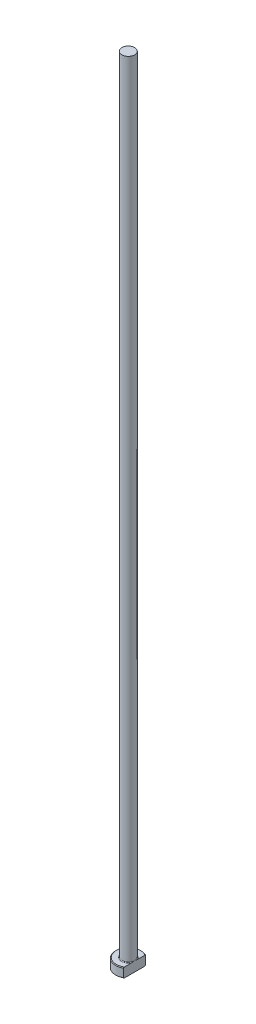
from build123d import *
from build123d.topology import SkipClean

# Parameters (mm, degrees)
CHAMFER1_SIZE = 0.2
FILLET1_R     = 0.2
KEY_DEPTH     = 251.06399181


with BuildPart() as part:
    # Sketch1 → Revolve1 (revolve)
    with BuildSketch(Plane.XY, mode=Mode.PRIVATE) as revolve1_sk:
        Polygon((0, 0), (-4, 0), (-4, 3), (-2, 3), (-2, 250), (0, 250), align=None)
    revolve(revolve1_sk.sketch.rotate(Axis((0, 259.958771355, 0), (0, -1, 0)), 270), axis=Axis((0, 259.958771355, 0), (0, -1, 0)))

    # Chamfer1
    chamfer1_edges = [part.edges().sort_by_distance(p)[0] for p in [
        (0, 3, -4),
        (0, 0, -4),
    ]]
    chamfer(chamfer1_edges, length=CHAMFER1_SIZE)

    # Fillet1
    fillet1_edges = [part.edges().sort_by_distance(p)[0] for p in [
        (0, 3, -2),
    ]]
    fillet(fillet1_edges, radius=FILLET1_R)

    # Sketch2 → KEY (cut, through all)
    with SkipClean():  # the faces are left unmerged after this step: merging them gives an invalid solid
        with BuildSketch(Plane(origin=(0, 0, 0), x_dir=(1, 0, 0), z_dir=(0, 1, 0))):
            with BuildLine():
                Line((2, 3.464101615), (2, -3.464101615))
                ThreePointArc((2, -3.464101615), (4, 0), (2, 3.464101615))
            make_face()
        extrude(amount=KEY_DEPTH, mode=Mode.SUBTRACT)


solid = part.part
